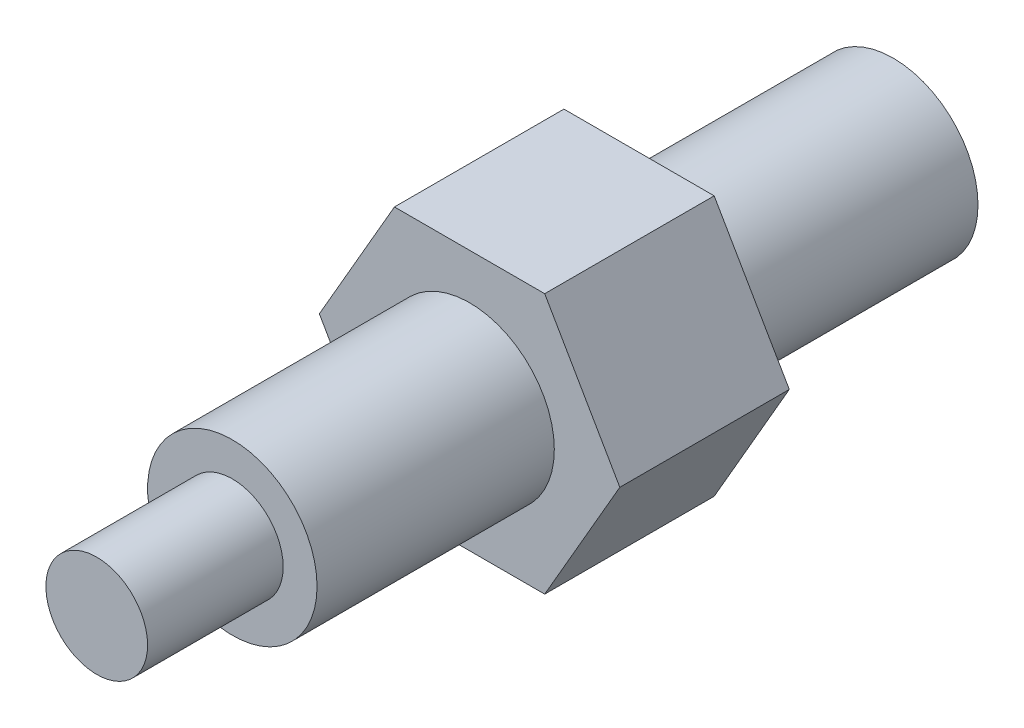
from build123d import *

# Parameters (mm, degrees)
BASE_EXTRUSION_DEPTH = 10
ESQUISSE2_R          = 5
BOSS_EXTRU_1_DEPTH   = 14
ESQUISSE3_R          = 3
BOSS_EXTRU_2_DEPTH   = 8
BOSS_EXTRU_3_START   = 15
ESQUISSE5_R          = 5
BOSS_EXTRU_3_DEPTH   = 15


with BuildPart() as part:
    # Esquisse1 → Base-Extrusion (new body)
    with BuildSketch(Plane.XY):
        Polygon((4.432612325, -7.677509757), (8.86522465, 0), (4.432612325, 7.677509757), (-4.432612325, 7.677509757), (-8.86522465, 0), (-4.432612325, -7.677509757), align=None)
    extrude(amount=BASE_EXTRUSION_DEPTH)

    # Esquisse2 → Boss.-Extru.1 (add)
    with BuildSketch(Plane.XY.offset(10)):
        Circle(ESQUISSE2_R)
    extrude(amount=BOSS_EXTRU_1_DEPTH)

    # Esquisse3 → Boss.-Extru.2 (add)
    with BuildSketch(Plane.XY.offset(24)):
        Circle(ESQUISSE3_R)
    extrude(amount=BOSS_EXTRU_2_DEPTH)

    # Esquisse5 → Boss.-Extru.3 (add)
    with BuildSketch(Plane(origin=(0, 0, 0), x_dir=(-1, 0, 0), z_dir=(0, 0, -1)).offset(BOSS_EXTRU_3_START)):
        with Locations(Location((0, 0, 0), (0, 0, 180))):
            Circle(ESQUISSE5_R)
    extrude(amount=-BOSS_EXTRU_3_DEPTH)


solid = part.part
